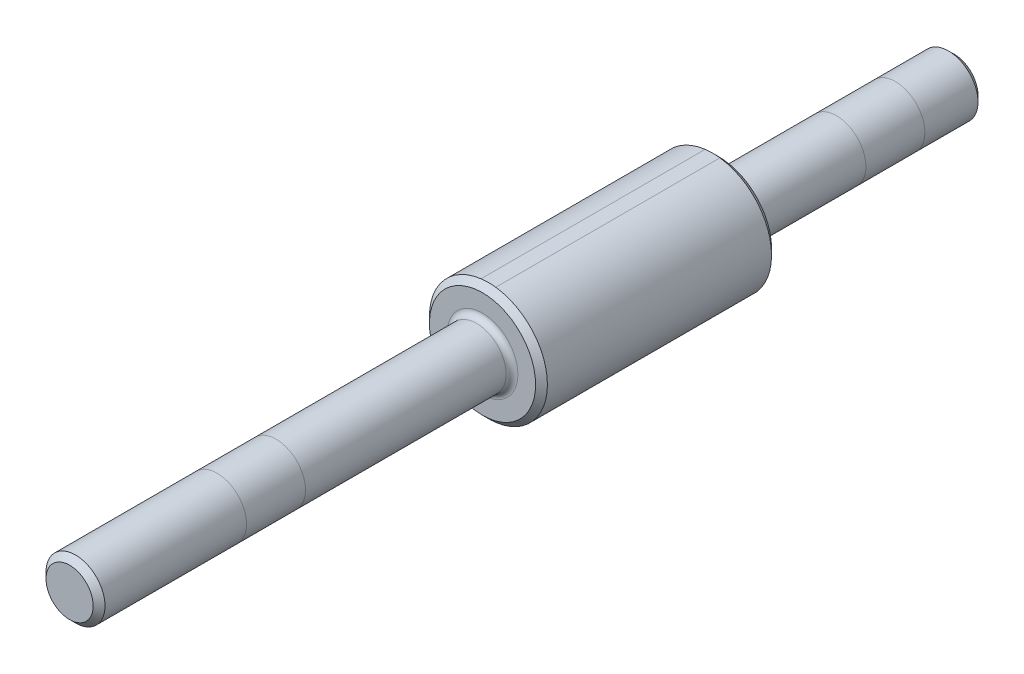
ISO-10303-21;
HEADER;
FILE_DESCRIPTION(('STEP AP214'),'2;1');
FILE_NAME('part.step','',(''),(''),'','','');
FILE_SCHEMA(('AUTOMOTIVE_DESIGN { 1 0 10303 214 1 1 1 1 }'));
ENDSEC;
DATA;
#1=APPLICATION_CONTEXT('core data for automotive mechanical design processes');
#2=APPLICATION_PROTOCOL_DEFINITION('international standard','automotive_design',2000,#1);
#3=PRODUCT_CONTEXT('',#1,'mechanical');
#4=PRODUCT('Part','Part','',(#3));
#5=PRODUCT_RELATED_PRODUCT_CATEGORY('part','',(#4));
#6=PRODUCT_DEFINITION_FORMATION('','',#4);
#7=PRODUCT_DEFINITION_CONTEXT('part definition',#1,'design');
#8=PRODUCT_DEFINITION('design','',#6,#7);
#9=PRODUCT_DEFINITION_SHAPE('','',#8);
#10=(LENGTH_UNIT() NAMED_UNIT(*) SI_UNIT(.MILLI.,.METRE.));
#11=(NAMED_UNIT(*) PLANE_ANGLE_UNIT() SI_UNIT($,.RADIAN.));
#12=(NAMED_UNIT(*) SI_UNIT($,.STERADIAN.) SOLID_ANGLE_UNIT());
#13=UNCERTAINTY_MEASURE_WITH_UNIT(LENGTH_MEASURE(1.E-05),#10,'distance_accuracy_value','');
#14=(GEOMETRIC_REPRESENTATION_CONTEXT(3) GLOBAL_UNCERTAINTY_ASSIGNED_CONTEXT((#13)) GLOBAL_UNIT_ASSIGNED_CONTEXT((#10,
#11,#12)) REPRESENTATION_CONTEXT('',''));
#15=CARTESIAN_POINT('',(0.,0.,0.));
#16=DIRECTION('',(0.,0.,1.));
#17=DIRECTION('',(1.,0.,0.));
#18=AXIS2_PLACEMENT_3D('',#15,#16,#17);
#19=CARTESIAN_POINT('',(0.,0.,150.));
#20=DIRECTION('',(0.,0.,-1.));
#21=DIRECTION('',(-1.,0.,0.));
#22=AXIS2_PLACEMENT_3D('',#19,#20,#21);
#23=CYLINDRICAL_SURFACE('',#22,5.);
#24=CARTESIAN_POINT('',(0.,0.,149.));
#25=DIRECTION('',(0.,0.,1.));
#26=DIRECTION('',(1.,0.,0.));
#27=AXIS2_PLACEMENT_3D('',#24,#25,#26);
#28=CIRCLE('',#27,5.);
#29=CARTESIAN_POINT('',(5.,0.,149.));
#30=VERTEX_POINT('',#29);
#31=EDGE_CURVE('E111',#30,#30,#28,.F.);
#32=ORIENTED_EDGE('',*,*,#31,.T.);
#33=EDGE_LOOP('',(#32));
#34=FACE_BOUND('',#33,.T.);
#35=CARTESIAN_POINT('',(0.,0.,125.));
#36=DIRECTION('',(0.,0.,-1.));
#37=DIRECTION('',(-1.,0.,0.));
#38=AXIS2_PLACEMENT_3D('',#35,#36,#37);
#39=CIRCLE('',#38,5.);
#40=CARTESIAN_POINT('',(-5.,0.,125.));
#41=VERTEX_POINT('',#40);
#42=EDGE_CURVE('E11',#41,#41,#39,.T.);
#43=ORIENTED_EDGE('',*,*,#42,.F.);
#44=EDGE_LOOP('',(#43));
#45=FACE_BOUND('',#44,.T.);
#46=ADVANCED_FACE('F32',(#34,#45),#23,.T.);
#47=CARTESIAN_POINT('',(0.,0.,81.));
#48=DIRECTION('',(0.,0.,1.));
#49=DIRECTION('',(1.,0.,0.));
#50=AXIS2_PLACEMENT_3D('',#47,#48,#49);
#51=CIRCLE('',#50,5.);
#52=CARTESIAN_POINT('',(5.,0.,81.));
#53=VERTEX_POINT('',#52);
#54=EDGE_CURVE('E193',#53,#53,#51,.T.);
#55=ORIENTED_EDGE('',*,*,#54,.T.);
#56=EDGE_LOOP('',(#55));
#57=FACE_BOUND('',#56,.T.);
#58=CARTESIAN_POINT('',(0.,0.,115.));
#59=DIRECTION('',(0.,0.,1.));
#60=DIRECTION('',(1.,0.,0.));
#61=AXIS2_PLACEMENT_3D('',#58,#59,#60);
#62=CIRCLE('',#61,5.);
#63=CARTESIAN_POINT('',(5.,0.,115.));
#64=VERTEX_POINT('',#63);
#65=EDGE_CURVE('E41',#64,#64,#62,.T.);
#66=ORIENTED_EDGE('',*,*,#65,.F.);
#67=EDGE_LOOP('',(#66));
#68=FACE_BOUND('',#67,.T.);
#69=ADVANCED_FACE('F136',(#57,#68),#23,.T.);
#70=CARTESIAN_POINT('',(0.,0.,39.));
#71=DIRECTION('',(0.,0.,1.));
#72=DIRECTION('',(1.,0.,0.));
#73=AXIS2_PLACEMENT_3D('',#70,#71,#72);
#74=CIRCLE('',#73,5.);
#75=CARTESIAN_POINT('',(5.,0.,39.));
#76=VERTEX_POINT('',#75);
#77=EDGE_CURVE('E196',#76,#76,#74,.F.);
#78=ORIENTED_EDGE('',*,*,#77,.T.);
#79=EDGE_LOOP('',(#78));
#80=FACE_BOUND('',#79,.T.);
#81=CARTESIAN_POINT('',(0.,0.,20.));
#82=DIRECTION('',(0.,0.,-1.));
#83=DIRECTION('',(-1.,0.,0.));
#84=AXIS2_PLACEMENT_3D('',#81,#82,#83);
#85=CIRCLE('',#84,5.);
#86=CARTESIAN_POINT('',(-5.,0.,20.));
#87=VERTEX_POINT('',#86);
#88=EDGE_CURVE('E125',#87,#87,#85,.T.);
#89=ORIENTED_EDGE('',*,*,#88,.F.);
#90=EDGE_LOOP('',(#89));
#91=FACE_BOUND('',#90,.T.);
#92=ADVANCED_FACE('F138',(#80,#91),#23,.T.);
#93=CARTESIAN_POINT('',(0.,0.,1.00000000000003));
#94=DIRECTION('',(0.,0.,1.));
#95=DIRECTION('',(1.,0.,0.));
#96=AXIS2_PLACEMENT_3D('',#93,#94,#95);
#97=CIRCLE('',#96,5.);
#98=CARTESIAN_POINT('',(5.,0.,1.00000000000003));
#99=VERTEX_POINT('',#98);
#100=EDGE_CURVE('E95',#99,#99,#97,.T.);
#101=ORIENTED_EDGE('',*,*,#100,.T.);
#102=EDGE_LOOP('',(#101));
#103=FACE_BOUND('',#102,.T.);
#104=CARTESIAN_POINT('',(0.,0.,10.));
#105=DIRECTION('',(0.,0.,1.));
#106=DIRECTION('',(1.,0.,0.));
#107=AXIS2_PLACEMENT_3D('',#104,#105,#106);
#108=CIRCLE('',#107,5.);
#109=CARTESIAN_POINT('',(5.,0.,10.));
#110=VERTEX_POINT('',#109);
#111=EDGE_CURVE('E121',#110,#110,#108,.T.);
#112=ORIENTED_EDGE('',*,*,#111,.F.);
#113=EDGE_LOOP('',(#112));
#114=FACE_BOUND('',#113,.T.);
#115=ADVANCED_FACE('F145',(#103,#114),#23,.T.);
#116=CARTESIAN_POINT('',(0.,0.,80.));
#117=DIRECTION('',(0.,0.,-1.));
#118=DIRECTION('',(-1.,0.,0.));
#119=AXIS2_PLACEMENT_3D('',#116,#117,#118);
#120=CYLINDRICAL_SURFACE('',#119,10.);
#121=DIRECTION('',(0.,0.,-1.));
#122=VECTOR('',#121,1.);
#123=CARTESIAN_POINT('',(-1.24999999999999,-9.92156741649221,80.));
#124=LINE('',#123,#122);
#125=CARTESIAN_POINT('',(-1.24999999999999,-9.92156741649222,79.0000000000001));
#126=VERTEX_POINT('',#125);
#127=CARTESIAN_POINT('',(-1.25,-9.92156741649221,41.0000000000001));
#128=VERTEX_POINT('',#127);
#129=EDGE_CURVE('E118',#126,#128,#124,.T.);
#130=ORIENTED_EDGE('',*,*,#129,.F.);
#131=CARTESIAN_POINT('',(0.,0.,79.0000000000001));
#132=DIRECTION('',(0.,0.,1.));
#133=DIRECTION('',(1.,0.,0.));
#134=AXIS2_PLACEMENT_3D('',#131,#132,#133);
#135=CIRCLE('',#134,10.);
#136=CARTESIAN_POINT('',(-1.24999999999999,9.92156741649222,79.0000000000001));
#137=VERTEX_POINT('',#136);
#138=EDGE_CURVE('E202',#126,#137,#135,.F.);
#139=ORIENTED_EDGE('',*,*,#138,.T.);
#140=DIRECTION('',(0.,0.,-1.));
#141=VECTOR('',#140,1.);
#142=CARTESIAN_POINT('',(-1.24999999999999,9.92156741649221,80.));
#143=LINE('',#142,#141);
#144=CARTESIAN_POINT('',(-1.25,9.92156741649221,41.0000000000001));
#145=VERTEX_POINT('',#144);
#146=EDGE_CURVE('E56',#145,#137,#143,.F.);
#147=ORIENTED_EDGE('',*,*,#146,.F.);
#148=CARTESIAN_POINT('',(0.,0.,41.0000000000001));
#149=DIRECTION('',(0.,0.,1.));
#150=DIRECTION('',(1.,0.,0.));
#151=AXIS2_PLACEMENT_3D('',#148,#149,#150);
#152=CIRCLE('',#151,10.);
#153=EDGE_CURVE('E92',#145,#128,#152,.T.);
#154=ORIENTED_EDGE('',*,*,#153,.T.);
#155=EDGE_LOOP('',(#130,#139,#147,#154));
#156=FACE_BOUND('',#155,.T.);
#157=ADVANCED_FACE('F206',(#156),#120,.T.);
#158=CARTESIAN_POINT('',(1.25000000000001,-9.92156741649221,79.0000000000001));
#159=VERTEX_POINT('',#158);
#160=EDGE_CURVE('E87',#159,#126,#135,.F.);
#161=ORIENTED_EDGE('',*,*,#160,.T.);
#162=ORIENTED_EDGE('',*,*,#129,.T.);
#163=CARTESIAN_POINT('',(1.25000000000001,-9.92156741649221,41.0000000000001));
#164=VERTEX_POINT('',#163);
#165=EDGE_CURVE('E86',#128,#164,#152,.T.);
#166=ORIENTED_EDGE('',*,*,#165,.T.);
#167=DIRECTION('',(0.,0.,-1.));
#168=VECTOR('',#167,1.);
#169=CARTESIAN_POINT('',(1.25000000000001,-9.92156741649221,80.));
#170=LINE('',#169,#168);
#171=EDGE_CURVE('E78',#164,#159,#170,.F.);
#172=ORIENTED_EDGE('',*,*,#171,.T.);
#173=EDGE_LOOP('',(#161,#162,#166,#172));
#174=FACE_BOUND('',#173,.T.);
#175=ADVANCED_FACE('F207',(#174),#120,.T.);
#176=DIRECTION('',(0.,0.,-1.));
#177=VECTOR('',#176,1.);
#178=CARTESIAN_POINT('',(1.25000000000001,9.92156741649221,80.));
#179=LINE('',#178,#177);
#180=CARTESIAN_POINT('',(1.25000000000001,9.92156741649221,79.0000000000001));
#181=VERTEX_POINT('',#180);
#182=CARTESIAN_POINT('',(1.25000000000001,9.92156741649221,41.0000000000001));
#183=VERTEX_POINT('',#182);
#184=EDGE_CURVE('E48',#181,#183,#179,.T.);
#185=ORIENTED_EDGE('',*,*,#184,.F.);
#186=EDGE_CURVE('E200',#181,#159,#135,.F.);
#187=ORIENTED_EDGE('',*,*,#186,.T.);
#188=ORIENTED_EDGE('',*,*,#171,.F.);
#189=EDGE_CURVE('E81',#164,#183,#152,.T.);
#190=ORIENTED_EDGE('',*,*,#189,.T.);
#191=EDGE_LOOP('',(#185,#187,#188,#190));
#192=FACE_BOUND('',#191,.T.);
#193=ADVANCED_FACE('F82',(#192),#120,.T.);
#194=ORIENTED_EDGE('',*,*,#42,.T.);
#195=EDGE_LOOP('',(#194));
#196=FACE_BOUND('',#195,.T.);
#197=ORIENTED_EDGE('',*,*,#65,.T.);
#198=EDGE_LOOP('',(#197));
#199=FACE_BOUND('',#198,.T.);
#200=ADVANCED_FACE('F134',(#196,#199),#23,.T.);
#201=CARTESIAN_POINT('',(0.,0.,150.));
#202=DIRECTION('',(0.,0.,1.));
#203=DIRECTION('',(1.,0.,0.));
#204=AXIS2_PLACEMENT_3D('',#201,#202,#203);
#205=PLANE('',#204);
#206=CARTESIAN_POINT('',(0.,0.,150.));
#207=DIRECTION('',(0.,0.,1.));
#208=DIRECTION('',(1.,0.,0.));
#209=AXIS2_PLACEMENT_3D('',#206,#207,#208);
#210=CIRCLE('',#209,4.00000000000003);
#211=CARTESIAN_POINT('',(4.00000000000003,0.,150.));
#212=VERTEX_POINT('',#211);
#213=EDGE_CURVE('E108',#212,#212,#210,.T.);
#214=ORIENTED_EDGE('',*,*,#213,.T.);
#215=EDGE_LOOP('',(#214));
#216=FACE_BOUND('',#215,.T.);
#217=ADVANCED_FACE('F152',(#216),#205,.T.);
#218=CARTESIAN_POINT('',(0.,0.,80.));
#219=DIRECTION('',(0.,0.,1.));
#220=DIRECTION('',(1.,0.,0.));
#221=AXIS2_PLACEMENT_3D('',#218,#219,#220);
#222=PLANE('',#221);
#223=CARTESIAN_POINT('',(0.,0.,80.));
#224=DIRECTION('',(0.,0.,1.));
#225=DIRECTION('',(1.,0.,0.));
#226=AXIS2_PLACEMENT_3D('',#223,#224,#225);
#227=CIRCLE('',#226,9.00000000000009);
#228=CARTESIAN_POINT('',(9.00000000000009,0.,80.));
#229=VERTEX_POINT('',#228);
#230=EDGE_CURVE('E105',#229,#229,#227,.T.);
#231=ORIENTED_EDGE('',*,*,#230,.T.);
#232=EDGE_LOOP('',(#231));
#233=FACE_BOUND('',#232,.T.);
#234=CARTESIAN_POINT('',(0.,0.,80.));
#235=DIRECTION('',(0.,0.,1.));
#236=DIRECTION('',(1.,0.,0.));
#237=AXIS2_PLACEMENT_3D('',#234,#235,#236);
#238=CIRCLE('',#237,6.);
#239=CARTESIAN_POINT('',(6.,0.,80.));
#240=VERTEX_POINT('',#239);
#241=EDGE_CURVE('E191',#240,#240,#238,.F.);
#242=ORIENTED_EDGE('',*,*,#241,.T.);
#243=EDGE_LOOP('',(#242));
#244=FACE_BOUND('',#243,.T.);
#245=ADVANCED_FACE('F184',(#233,#244),#222,.T.);
#246=CARTESIAN_POINT('',(0.,0.,40.));
#247=DIRECTION('',(0.,0.,1.));
#248=DIRECTION('',(1.,0.,0.));
#249=AXIS2_PLACEMENT_3D('',#246,#247,#248);
#250=PLANE('',#249);
#251=CARTESIAN_POINT('',(0.,0.,40.));
#252=DIRECTION('',(0.,0.,1.));
#253=DIRECTION('',(1.,0.,0.));
#254=AXIS2_PLACEMENT_3D('',#251,#252,#253);
#255=CIRCLE('',#254,8.99999999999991);
#256=CARTESIAN_POINT('',(8.99999999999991,0.,40.));
#257=VERTEX_POINT('',#256);
#258=EDGE_CURVE('E93',#257,#257,#255,.F.);
#259=ORIENTED_EDGE('',*,*,#258,.T.);
#260=EDGE_LOOP('',(#259));
#261=FACE_BOUND('',#260,.T.);
#262=CARTESIAN_POINT('',(0.,0.,40.));
#263=DIRECTION('',(0.,0.,1.));
#264=DIRECTION('',(1.,0.,0.));
#265=AXIS2_PLACEMENT_3D('',#262,#263,#264);
#266=CIRCLE('',#265,6.);
#267=CARTESIAN_POINT('',(6.,0.,40.));
#268=VERTEX_POINT('',#267);
#269=EDGE_CURVE('E192',#268,#268,#266,.T.);
#270=ORIENTED_EDGE('',*,*,#269,.T.);
#271=EDGE_LOOP('',(#270));
#272=FACE_BOUND('',#271,.T.);
#273=ADVANCED_FACE('F187',(#261,#272),#250,.F.);
#274=EDGE_CURVE('E75',#183,#145,#152,.T.);
#275=ORIENTED_EDGE('',*,*,#274,.T.);
#276=ORIENTED_EDGE('',*,*,#146,.T.);
#277=EDGE_CURVE('E76',#137,#181,#135,.F.);
#278=ORIENTED_EDGE('',*,*,#277,.T.);
#279=ORIENTED_EDGE('',*,*,#184,.T.);
#280=EDGE_LOOP('',(#275,#276,#278,#279));
#281=FACE_BOUND('',#280,.T.);
#282=ADVANCED_FACE('F73',(#281),#120,.T.);
#283=CARTESIAN_POINT('',(0.,0.,0.));
#284=DIRECTION('',(0.,0.,1.));
#285=DIRECTION('',(1.,0.,0.));
#286=AXIS2_PLACEMENT_3D('',#283,#284,#285);
#287=PLANE('',#286);
#288=CARTESIAN_POINT('',(0.,0.,0.));
#289=DIRECTION('',(0.,0.,1.));
#290=DIRECTION('',(1.,0.,0.));
#291=AXIS2_PLACEMENT_3D('',#288,#289,#290);
#292=CIRCLE('',#291,3.99999999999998);
#293=CARTESIAN_POINT('',(3.99999999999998,0.,0.));
#294=VERTEX_POINT('',#293);
#295=EDGE_CURVE('E102',#294,#294,#292,.F.);
#296=ORIENTED_EDGE('',*,*,#295,.T.);
#297=EDGE_LOOP('',(#296));
#298=FACE_BOUND('',#297,.T.);
#299=ADVANCED_FACE('F155',(#298),#287,.F.);
#300=ORIENTED_EDGE('',*,*,#88,.T.);
#301=EDGE_LOOP('',(#300));
#302=FACE_BOUND('',#301,.T.);
#303=ORIENTED_EDGE('',*,*,#111,.T.);
#304=EDGE_LOOP('',(#303));
#305=FACE_BOUND('',#304,.T.);
#306=ADVANCED_FACE('F154',(#302,#305),#23,.T.);
#307=CARTESIAN_POINT('',(0.,0.,81.));
#308=DIRECTION('',(0.,0.,1.));
#309=DIRECTION('',(1.,0.,0.));
#310=AXIS2_PLACEMENT_3D('',#307,#308,#309);
#311=TOROIDAL_SURFACE('',#310,6.,1.);
#312=ORIENTED_EDGE('',*,*,#241,.F.);
#313=EDGE_LOOP('',(#312));
#314=FACE_BOUND('',#313,.T.);
#315=ORIENTED_EDGE('',*,*,#54,.F.);
#316=EDGE_LOOP('',(#315));
#317=FACE_BOUND('',#316,.T.);
#318=ADVANCED_FACE('F157',(#314,#317),#311,.F.);
#319=CARTESIAN_POINT('',(0.,0.,39.));
#320=DIRECTION('',(0.,0.,1.));
#321=DIRECTION('',(1.,0.,0.));
#322=AXIS2_PLACEMENT_3D('',#319,#320,#321);
#323=TOROIDAL_SURFACE('',#322,6.,1.);
#324=ORIENTED_EDGE('',*,*,#77,.F.);
#325=EDGE_LOOP('',(#324));
#326=FACE_BOUND('',#325,.T.);
#327=ORIENTED_EDGE('',*,*,#269,.F.);
#328=EDGE_LOOP('',(#327));
#329=FACE_BOUND('',#328,.T.);
#330=ADVANCED_FACE('F160',(#326,#329),#323,.F.);
#331=CARTESIAN_POINT('',(0.,0.,41.0000000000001));
#332=DIRECTION('',(0.,0.,1.));
#333=DIRECTION('',(1.,0.,0.));
#334=AXIS2_PLACEMENT_3D('',#331,#332,#333);
#335=CONICAL_SURFACE('',#334,10.,0.785398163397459);
#336=ORIENTED_EDGE('',*,*,#258,.F.);
#337=EDGE_LOOP('',(#336));
#338=FACE_BOUND('',#337,.T.);
#339=ORIENTED_EDGE('',*,*,#274,.F.);
#340=ORIENTED_EDGE('',*,*,#189,.F.);
#341=ORIENTED_EDGE('',*,*,#165,.F.);
#342=ORIENTED_EDGE('',*,*,#153,.F.);
#343=EDGE_LOOP('',(#339,#340,#341,#342));
#344=FACE_BOUND('',#343,.T.);
#345=ADVANCED_FACE('F90',(#338,#344),#335,.T.);
#346=CARTESIAN_POINT('',(0.,0.,1.00000000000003));
#347=DIRECTION('',(0.,0.,1.));
#348=DIRECTION('',(1.,0.,0.));
#349=AXIS2_PLACEMENT_3D('',#346,#347,#348);
#350=CONICAL_SURFACE('',#349,5.,0.785398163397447);
#351=ORIENTED_EDGE('',*,*,#295,.F.);
#352=EDGE_LOOP('',(#351));
#353=FACE_BOUND('',#352,.T.);
#354=ORIENTED_EDGE('',*,*,#100,.F.);
#355=EDGE_LOOP('',(#354));
#356=FACE_BOUND('',#355,.T.);
#357=ADVANCED_FACE('F167',(#353,#356),#350,.T.);
#358=CARTESIAN_POINT('',(0.,0.,80.));
#359=DIRECTION('',(0.,0.,-1.));
#360=DIRECTION('',(-1.,0.,0.));
#361=AXIS2_PLACEMENT_3D('',#358,#359,#360);
#362=CONICAL_SURFACE('',#361,9.00000000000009,0.785398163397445);
#363=ORIENTED_EDGE('',*,*,#160,.F.);
#364=ORIENTED_EDGE('',*,*,#186,.F.);
#365=ORIENTED_EDGE('',*,*,#277,.F.);
#366=ORIENTED_EDGE('',*,*,#138,.F.);
#367=EDGE_LOOP('',(#363,#364,#365,#366));
#368=FACE_BOUND('',#367,.T.);
#369=ORIENTED_EDGE('',*,*,#230,.F.);
#370=EDGE_LOOP('',(#369));
#371=FACE_BOUND('',#370,.T.);
#372=ADVANCED_FACE('F170',(#368,#371),#362,.T.);
#373=CARTESIAN_POINT('',(0.,0.,150.));
#374=DIRECTION('',(0.,0.,-1.));
#375=DIRECTION('',(-1.,0.,0.));
#376=AXIS2_PLACEMENT_3D('',#373,#374,#375);
#377=CONICAL_SURFACE('',#376,4.00000000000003,0.785398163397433);
#378=ORIENTED_EDGE('',*,*,#31,.F.);
#379=EDGE_LOOP('',(#378));
#380=FACE_BOUND('',#379,.T.);
#381=ORIENTED_EDGE('',*,*,#213,.F.);
#382=EDGE_LOOP('',(#381));
#383=FACE_BOUND('',#382,.T.);
#384=ADVANCED_FACE('F34',(#380,#383),#377,.T.);
#385=CLOSED_SHELL('',(#46,#69,#92,#115,#157,#175,#193,#200,#217,#245,#273,#282,#299,#306,#318,
#330,#345,#357,#372,#384));
#386=MANIFOLD_SOLID_BREP('B2',#385);
#387=ADVANCED_BREP_SHAPE_REPRESENTATION('',(#18,#386),#14);
#388=SHAPE_DEFINITION_REPRESENTATION(#9,#387);
ENDSEC;
END-ISO-10303-21;
